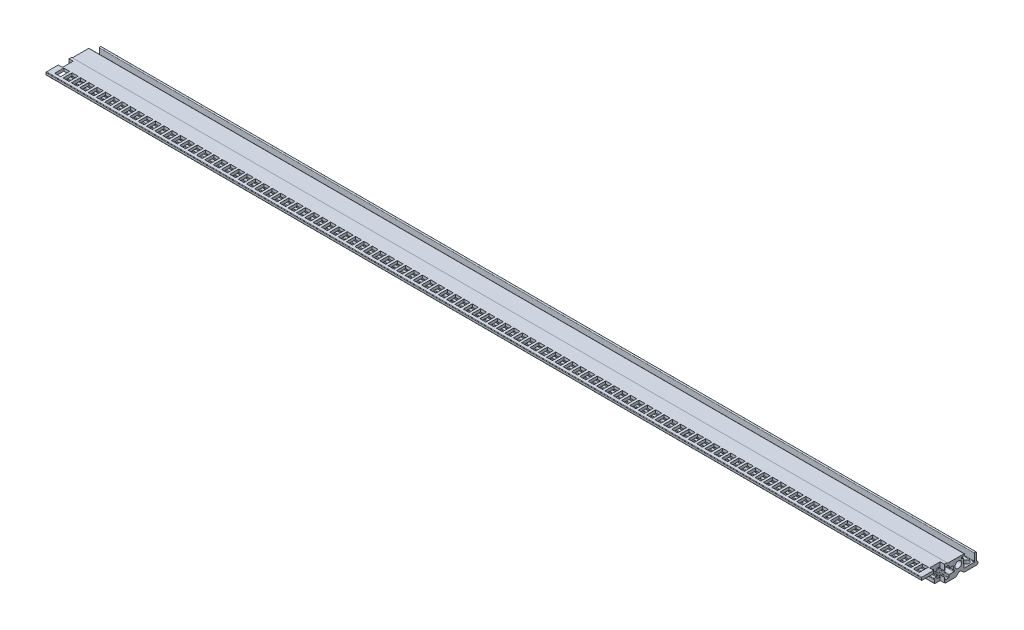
from build123d import *

# Parameters (mm, degrees)
SKETCH_1_R          = 2
EXTRUDE_1_DEPTH     = 266.7
EXTRUDE_4_DEPTH     = 533.4
EXTRUDE_3_DEPTH     = 533.4
CUT_EXTRUDE_1_REACH = 270.187
SKETCH_3_W          = 2.54
SKETCH_3_H          = 6.5
SKETCH_4_R          = 1.65
CUT_EXTRUDE_2_DEPTH = 9.8
SKETCH_5_W          = 3.6
SKETCH_5_H          = 5.5
CUT_EXTRUDE_3_DEPTH = 9.9
FILLET_1_R          = 0.3


with BuildPart() as part:
    # Sketch 1 → Extrude 1 (new, symmetric)
    with BuildSketch(Plane(origin=(0, 0, 0), x_dir=(0, 0, -1), z_dir=(1, 0, 0))):
        with BuildLine():
            Line((2.006061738, 2.145757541), (2.056061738, 2.145757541))
            ThreePointArc((2.056061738, 2.145757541), (2.197483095, 2.087178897), (2.256061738, 1.945757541))
            Line((2.256061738, 1.945757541), (2.256061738, -0.054242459))
            ThreePointArc((2.256061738, -0.054242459), (2.343929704, -0.266374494), (2.556061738, -0.354242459))
            Line((2.556061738, -0.354242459), (6.056061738, -0.354242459))
            ThreePointArc((6.056061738, -0.354242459), (6.245798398, -0.421863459), (6.350000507, -0.594242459))
            ThreePointArc((6.350000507, -0.594242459), (6.41946858, -0.709161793), (6.545959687, -0.754242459))
            Line((6.545959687, -0.754242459), (12.640079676, -0.754242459))
            ThreePointArc((12.640079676, -0.754242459), (12.748258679, -0.734059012), (12.841881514, -0.676224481))
            Line((12.841881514, -0.676224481), (14.682337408, 0.99691724))
            ThreePointArc((14.682337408, 0.99691724), (14.873755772, 1.07475547), (15.070100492, 1.010346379))
            ThreePointArc((15.070100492, 1.010346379), (15.256061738, 0.945757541), (15.442022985, 1.010346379))
            ThreePointArc((15.442022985, 1.010346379), (15.638367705, 1.07475547), (15.829786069, 0.99691724))
            Line((15.829786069, 0.99691724), (17.670241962, -0.676224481))
            ThreePointArc((17.670241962, -0.676224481), (17.763864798, -0.734059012), (17.872043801, -0.754242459))
            Line((17.872043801, -0.754242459), (25.156061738, -0.754242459))
            ThreePointArc((25.156061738, -0.754242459), (26.244537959, 0.186951), (25.470347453, 1.399903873))
            ThreePointArc((25.470347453, 1.399903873), (25.315526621, 1.508114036), (25.256061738, 1.687398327))
            Line((25.256061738, 1.687398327), (25.256061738, 6.045757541))
            ThreePointArc((25.256061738, 6.045757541), (24.756061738, 6.545757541), (24.256061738, 6.045757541))
            Line((24.256061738, 6.045757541), (24.256061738, 1.745757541))
            ThreePointArc((24.256061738, 1.745757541), (24.168193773, 1.533625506), (23.956061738, 1.445757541))
            Line((23.956061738, 1.445757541), (18.056061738, 1.445757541))
            ThreePointArc((18.056061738, 1.445757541), (17.843929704, 1.533625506), (17.756061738, 1.745757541))
            Line((17.756061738, 1.745757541), (17.756061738, 3.099347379))
            ThreePointArc((17.756061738, 3.099347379), (17.729266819, 3.199347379), (17.656061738, 3.27255246))
            ThreePointArc((17.656061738, 3.27255246), (17.582856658, 3.345757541), (17.556061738, 3.445757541))
            Line((17.556061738, 3.445757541), (17.556061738, 6.745757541))
            ThreePointArc((17.556061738, 6.745757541), (17.468193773, 6.957889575), (17.256061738, 7.045757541))
            Line((17.256061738, 7.045757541), (16.356061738, 7.045757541))
            ThreePointArc((16.356061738, 7.045757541), (16.143929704, 7.133625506), (16.056061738, 7.345757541))
            Line((16.056061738, 7.345757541), (16.056061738, 7.745757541))
            ThreePointArc((16.056061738, 7.745757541), (16.143929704, 7.957889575), (16.356061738, 8.045757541))
            Line((16.356061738, 8.045757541), (17.756061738, 8.045757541))
            ThreePointArc((17.756061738, 8.045757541), (17.968193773, 8.133625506), (18.056061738, 8.345757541))
            Line((18.056061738, 8.345757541), (18.056061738, 8.745757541))
            ThreePointArc((18.056061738, 8.745757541), (17.968193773, 8.957889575), (17.756061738, 9.045757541))
            Line((17.756061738, 9.045757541), (-7.943938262, 9.045757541))
            ThreePointArc((-7.943938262, 9.045757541), (-8.156070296, 8.957889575), (-8.243938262, 8.745757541))
            Line((-8.243938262, 8.745757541), (-8.243938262, 8.145757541))
            ThreePointArc((-8.243938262, 8.145757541), (-8.156070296, 7.933625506), (-7.943938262, 7.845757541))
            Line((-7.943938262, 7.845757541), (1.456061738, 7.845757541))
            ThreePointArc((1.456061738, 7.845757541), (1.668193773, 7.757889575), (1.756061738, 7.545757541))
            Line((1.756061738, 7.545757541), (1.756061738, 6.345757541))
            ThreePointArc((1.756061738, 6.345757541), (1.843929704, 6.133625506), (2.056061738, 6.045757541))
            Line((2.056061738, 6.045757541), (3.456061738, 6.045757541))
            ThreePointArc((3.456061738, 6.045757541), (3.668193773, 6.133625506), (3.756061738, 6.345757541))
            Line((3.756061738, 6.345757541), (3.756061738, 6.745757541))
            ThreePointArc((3.756061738, 6.745757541), (3.843929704, 6.957889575), (4.056061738, 7.045757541))
            Line((4.056061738, 7.045757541), (5.156061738, 7.045757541))
            ThreePointArc((5.156061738, 7.045757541), (5.368193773, 6.957889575), (5.456061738, 6.745757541))
            Line((5.456061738, 6.745757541), (5.456061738, 6.345757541))
            ThreePointArc((5.456061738, 6.345757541), (5.756061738, 6.045757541), (6.056061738, 6.345757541))
            Line((6.056061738, 6.345757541), (6.056061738, 7.405757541))
            ThreePointArc((6.056061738, 7.405757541), (6.143929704, 7.617889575), (6.356061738, 7.705757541))
            Line((6.356061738, 7.705757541), (8.156061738, 7.705757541))
            ThreePointArc((8.156061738, 7.705757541), (8.368193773, 7.617889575), (8.456061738, 7.405757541))
            Line((8.456061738, 7.405757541), (8.456061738, 6.345757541))
            ThreePointArc((8.456061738, 6.345757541), (8.543929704, 6.133625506), (8.756061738, 6.045757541))
            Line((8.756061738, 6.045757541), (10.980012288, 6.045757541))
            ThreePointArc((10.980012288, 6.045757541), (11.213256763, 5.934429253), (11.273389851, 5.683070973))
            ThreePointArc((11.273389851, 5.683070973), (11.28883719, 4.340010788), (11.879723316, 3.133817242))
            ThreePointArc((11.879723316, 3.133817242), (11.916556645, 2.816177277), (11.645985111, 2.645757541))
            Line((11.645985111, 2.645757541), (8.756061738, 2.645757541))
            ThreePointArc((8.756061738, 2.645757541), (8.543929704, 2.557889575), (8.456061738, 2.345757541))
            Line((8.456061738, 2.345757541), (8.456061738, 1.285757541))
            ThreePointArc((8.456061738, 1.285757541), (8.368193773, 1.073625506), (8.156061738, 0.985757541))
            Line((8.156061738, 0.985757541), (6.356061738, 0.985757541))
            ThreePointArc((6.356061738, 0.985757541), (6.143929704, 1.073625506), (6.056061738, 1.285757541))
            Line((6.056061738, 1.285757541), (6.056061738, 2.345757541))
            ThreePointArc((6.056061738, 2.345757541), (5.756061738, 2.645757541), (5.456061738, 2.345757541))
            Line((5.456061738, 2.345757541), (5.456061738, 1.945757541))
            ThreePointArc((5.456061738, 1.945757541), (5.368193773, 1.733625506), (5.156061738, 1.645757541))
            Line((5.156061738, 1.645757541), (4.056061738, 1.645757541))
            ThreePointArc((4.056061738, 1.645757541), (3.843929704, 1.733625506), (3.756061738, 1.945757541))
            Line((3.756061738, 1.945757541), (3.756061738, 2.345757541))
            ThreePointArc((3.756061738, 2.345757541), (3.668193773, 2.557889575), (3.456061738, 2.645757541))
            Line((3.456061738, 2.645757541), (2.006061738, 2.645757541))
            ThreePointArc((2.006061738, 2.645757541), (1.756061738, 2.395757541), (2.006061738, 2.145757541))
        make_face()
        with Locations((14.256061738, 5.045757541)):
            Circle(SKETCH_1_R, mode=Mode.SUBTRACT)
    extrude(amount=EXTRUDE_1_DEPTH, both=True)

    # Sketch 7 → Extrude 4 (add, through all)
    with BuildSketch(Plane(origin=(266.7, 0, 0), x_dir=(0, 0, -1), z_dir=(1, 0, 0))):
        with BuildLine():
            Line((-7.943938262, 9.045757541), (-8.243938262, 9.045757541))
            Line((-8.243938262, 9.045757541), (-8.243938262, 8.745757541))
            ThreePointArc((-8.243938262, 8.745757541), (-8.156070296, 8.957889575), (-7.943938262, 9.045757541))
        make_face()
    extrude(amount=-EXTRUDE_4_DEPTH)

    # Sketch 6 → Extrude 3 (add, through all)
    with BuildSketch(Plane.ZY.offset(266.7)):
        Polygon((-7.806061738, 9.045757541), (8.243938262, 9.045757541), (8.243938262, 9.545757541), (-7.306061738, 9.545757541), align=None)
    extrude(amount=-EXTRUDE_3_DEPTH)

    # Cut-Extrude 1: up to this face of the body (flat: up to its plane)
    cut_extrude_1_end = Plane(part.part.faces().sort_by_distance((0, -0.754242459, -9.593019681))[0])
    # Sketch 3 → Cut-Extrude 1 (cut, up to the picked face)
    with BuildSketch(Plane(origin=(0, 9.545757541, 0), x_dir=(1, 0, 0), z_dir=(0, 1, 0)), mode=Mode.PRIVATE) as cut_extrude_1_sk1:
        with Locations((265.43, 2.506061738)):
            Rectangle(SKETCH_3_W, SKETCH_3_H)
    cut_extrude_1_tool1 = split(extrude(cut_extrude_1_sk1.sketch, amount=-CUT_EXTRUDE_1_REACH, mode=Mode.PRIVATE), bisect_by=cut_extrude_1_end, keep=Keep.BOTH, mode=Mode.PRIVATE)
    # Sketch 3 → Cut-Extrude 1 (cut, up to the picked face)
    with BuildSketch(Plane(origin=(0, 9.545757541, 0), x_dir=(1, 0, 0), z_dir=(0, 1, 0)), mode=Mode.PRIVATE) as cut_extrude_1_sk2:
        with Locations((-265.43, 2.506061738)):
            Rectangle(SKETCH_3_W, SKETCH_3_H)
    cut_extrude_1_tool2 = split(extrude(cut_extrude_1_sk2.sketch, amount=-CUT_EXTRUDE_1_REACH, mode=Mode.PRIVATE), bisect_by=cut_extrude_1_end, keep=Keep.BOTH, mode=Mode.PRIVATE)
    add(cut_extrude_1_tool1.solids().sort_by(Axis((265.43, 9.545758, -2.506062), (0, -1, 0)))[0], mode=Mode.SUBTRACT)
    add(cut_extrude_1_tool2.solids().sort_by(Axis((-265.43, 9.545758, -2.506062), (0, -1, 0)))[0], mode=Mode.SUBTRACT)

    # Sketch 4 → Cut-Extrude 2 (cut)
    with BuildSketch(Plane(origin=(0, -0.754242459, 0), x_dir=(-1, 0, 0), z_dir=(0, -1, 0))):
        with Locations(Location((-264.16, 21.706061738, 0), (0, 0, 90))):
            Circle(SKETCH_4_R)
        with Locations(Location((-259.08, 21.706061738, 0), (0, 0, 90))):
            Circle(SKETCH_4_R)
        with Locations(Location((-254, 21.706061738, 0), (0, 0, 90))):
            Circle(SKETCH_4_R)
        with Locations(Location((-248.92, 21.706061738, 0), (0, 0, 90))):
            Circle(SKETCH_4_R)
        with Locations(Location((-243.84, 21.706061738, 0), (0, 0, 90))):
            Circle(SKETCH_4_R)
        with Locations(Location((-238.76, 21.706061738, 0), (0, 0, 90))):
            Circle(SKETCH_4_R)
        with Locations(Location((-233.68, 21.706061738, 0), (0, 0, 90))):
            Circle(SKETCH_4_R)
        with Locations(Location((-228.6, 21.706061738, 0), (0, 0, 90))):
            Circle(SKETCH_4_R)
        with Locations(Location((-223.52, 21.706061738, 0), (0, 0, 90))):
            Circle(SKETCH_4_R)
        with Locations(Location((-218.44, 21.706061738, 0), (0, 0, 90))):
            Circle(SKETCH_4_R)
        with Locations(Location((-213.36, 21.706061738, 0), (0, 0, 90))):
            Circle(SKETCH_4_R)
        with Locations(Location((-208.28, 21.706061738, 0), (0, 0, 90))):
            Circle(SKETCH_4_R)
        with Locations(Location((-203.2, 21.706061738, 0), (0, 0, 90))):
            Circle(SKETCH_4_R)
        with Locations(Location((-198.12, 21.706061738, 0), (0, 0, 90))):
            Circle(SKETCH_4_R)
        with Locations(Location((-193.04, 21.706061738, 0), (0, 0, 90))):
            Circle(SKETCH_4_R)
        with Locations(Location((-187.96, 21.706061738, 0), (0, 0, 90))):
            Circle(SKETCH_4_R)
        with Locations(Location((-182.88, 21.706061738, 0), (0, 0, 90))):
            Circle(SKETCH_4_R)
        with Locations(Location((-177.8, 21.706061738, 0), (0, 0, 90))):
            Circle(SKETCH_4_R)
        with Locations(Location((-172.72, 21.706061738, 0), (0, 0, 90))):
            Circle(SKETCH_4_R)
        with Locations(Location((-167.64, 21.706061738, 0), (0, 0, 90))):
            Circle(SKETCH_4_R)
        with Locations(Location((-162.56, 21.706061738, 0), (0, 0, 90))):
            Circle(SKETCH_4_R)
        with Locations(Location((-157.48, 21.706061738, 0), (0, 0, 90))):
            Circle(SKETCH_4_R)
        with Locations(Location((-152.4, 21.706061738, 0), (0, 0, 90))):
            Circle(SKETCH_4_R)
        with Locations(Location((-147.32, 21.706061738, 0), (0, 0, 90))):
            Circle(SKETCH_4_R)
        with Locations(Location((-142.24, 21.706061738, 0), (0, 0, 90))):
            Circle(SKETCH_4_R)
        with Locations(Location((-137.16, 21.706061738, 0), (0, 0, 90))):
            Circle(SKETCH_4_R)
        with Locations(Location((-132.08, 21.706061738, 0), (0, 0, 90))):
            Circle(SKETCH_4_R)
        with Locations(Location((-127, 21.706061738, 0), (0, 0, 90))):
            Circle(SKETCH_4_R)
        with Locations(Location((-121.92, 21.706061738, 0), (0, 0, 90))):
            Circle(SKETCH_4_R)
        with Locations(Location((-116.84, 21.706061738, 0), (0, 0, 90))):
            Circle(SKETCH_4_R)
        with Locations(Location((-111.76, 21.706061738, 0), (0, 0, 90))):
            Circle(SKETCH_4_R)
        with Locations(Location((-106.68, 21.706061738, 0), (0, 0, 90))):
            Circle(SKETCH_4_R)
        with Locations(Location((-101.6, 21.706061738, 0), (0, 0, 90))):
            Circle(SKETCH_4_R)
        with Locations(Location((-96.52, 21.706061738, 0), (0, 0, 90))):
            Circle(SKETCH_4_R)
        with Locations(Location((-91.44, 21.706061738, 0), (0, 0, 90))):
            Circle(SKETCH_4_R)
        with Locations(Location((-86.36, 21.706061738, 0), (0, 0, 90))):
            Circle(SKETCH_4_R)
        with Locations(Location((-81.28, 21.706061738, 0), (0, 0, 90))):
            Circle(SKETCH_4_R)
        with Locations(Location((-76.2, 21.706061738, 0), (0, 0, 90))):
            Circle(SKETCH_4_R)
        with Locations(Location((-71.12, 21.706061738, 0), (0, 0, 90))):
            Circle(SKETCH_4_R)
        with Locations(Location((-66.04, 21.706061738, 0), (0, 0, 90))):
            Circle(SKETCH_4_R)
        with Locations(Location((-60.96, 21.706061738, 0), (0, 0, 90))):
            Circle(SKETCH_4_R)
        with Locations(Location((-55.88, 21.706061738, 0), (0, 0, 90))):
            Circle(SKETCH_4_R)
        with Locations(Location((-50.8, 21.706061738, 0), (0, 0, 90))):
            Circle(SKETCH_4_R)
        with Locations(Location((-45.72, 21.706061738, 0), (0, 0, 90))):
            Circle(SKETCH_4_R)
        with Locations(Location((-40.64, 21.706061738, 0), (0, 0, 90))):
            Circle(SKETCH_4_R)
        with Locations(Location((-35.56, 21.706061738, 0), (0, 0, 90))):
            Circle(SKETCH_4_R)
        with Locations(Location((-30.48, 21.706061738, 0), (0, 0, 90))):
            Circle(SKETCH_4_R)
        with Locations(Location((-25.4, 21.706061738, 0), (0, 0, 90))):
            Circle(SKETCH_4_R)
        with Locations(Location((-20.32, 21.706061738, 0), (0, 0, 90))):
            Circle(SKETCH_4_R)
        with Locations(Location((-15.24, 21.706061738, 0), (0, 0, 90))):
            Circle(SKETCH_4_R)
        with Locations(Location((-10.16, 21.706061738, 0), (0, 0, 90))):
            Circle(SKETCH_4_R)
        with Locations(Location((-5.08, 21.706061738, 0), (0, 0, 90))):
            Circle(SKETCH_4_R)
        with Locations(Location((0, 21.706061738, 0), (0, 0, 90))):
            Circle(SKETCH_4_R)
        with Locations(Location((5.08, 21.706061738, 0), (0, 0, 90))):
            Circle(SKETCH_4_R)
        with Locations(Location((10.16, 21.706061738, 0), (0, 0, 90))):
            Circle(SKETCH_4_R)
        with Locations(Location((15.24, 21.706061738, 0), (0, 0, 90))):
            Circle(SKETCH_4_R)
        with Locations(Location((20.32, 21.706061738, 0), (0, 0, 90))):
            Circle(SKETCH_4_R)
        with Locations(Location((25.4, 21.706061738, 0), (0, 0, 90))):
            Circle(SKETCH_4_R)
        with Locations(Location((30.48, 21.706061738, 0), (0, 0, 90))):
            Circle(SKETCH_4_R)
        with Locations(Location((35.56, 21.706061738, 0), (0, 0, 90))):
            Circle(SKETCH_4_R)
        with Locations(Location((40.64, 21.706061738, 0), (0, 0, 90))):
            Circle(SKETCH_4_R)
        with Locations(Location((45.72, 21.706061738, 0), (0, 0, 90))):
            Circle(SKETCH_4_R)
        with Locations(Location((50.8, 21.706061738, 0), (0, 0, 90))):
            Circle(SKETCH_4_R)
        with Locations(Location((55.88, 21.706061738, 0), (0, 0, 90))):
            Circle(SKETCH_4_R)
        with Locations(Location((60.96, 21.706061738, 0), (0, 0, 90))):
            Circle(SKETCH_4_R)
        with Locations(Location((66.04, 21.706061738, 0), (0, 0, 90))):
            Circle(SKETCH_4_R)
        with Locations(Location((71.12, 21.706061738, 0), (0, 0, 90))):
            Circle(SKETCH_4_R)
        with Locations(Location((76.2, 21.706061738, 0), (0, 0, 90))):
            Circle(SKETCH_4_R)
        with Locations(Location((81.28, 21.706061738, 0), (0, 0, 90))):
            Circle(SKETCH_4_R)
        with Locations(Location((86.36, 21.706061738, 0), (0, 0, 90))):
            Circle(SKETCH_4_R)
        with Locations(Location((91.44, 21.706061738, 0), (0, 0, 90))):
            Circle(SKETCH_4_R)
        with Locations(Location((96.52, 21.706061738, 0), (0, 0, 90))):
            Circle(SKETCH_4_R)
        with Locations(Location((101.6, 21.706061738, 0), (0, 0, 90))):
            Circle(SKETCH_4_R)
        with Locations(Location((106.68, 21.706061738, 0), (0, 0, 90))):
            Circle(SKETCH_4_R)
        with Locations(Location((111.76, 21.706061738, 0), (0, 0, 90))):
            Circle(SKETCH_4_R)
        with Locations(Location((116.84, 21.706061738, 0), (0, 0, 90))):
            Circle(SKETCH_4_R)
        with Locations(Location((121.92, 21.706061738, 0), (0, 0, 90))):
            Circle(SKETCH_4_R)
        with Locations(Location((127, 21.706061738, 0), (0, 0, 90))):
            Circle(SKETCH_4_R)
        with Locations(Location((132.08, 21.706061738, 0), (0, 0, 90))):
            Circle(SKETCH_4_R)
        with Locations(Location((137.16, 21.706061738, 0), (0, 0, 90))):
            Circle(SKETCH_4_R)
        with Locations(Location((142.24, 21.706061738, 0), (0, 0, 90))):
            Circle(SKETCH_4_R)
        with Locations(Location((147.32, 21.706061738, 0), (0, 0, 90))):
            Circle(SKETCH_4_R)
        with Locations(Location((152.4, 21.706061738, 0), (0, 0, 90))):
            Circle(SKETCH_4_R)
        with Locations(Location((157.48, 21.706061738, 0), (0, 0, 90))):
            Circle(SKETCH_4_R)
        with Locations(Location((162.56, 21.706061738, 0), (0, 0, 90))):
            Circle(SKETCH_4_R)
        with Locations(Location((167.64, 21.706061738, 0), (0, 0, 90))):
            Circle(SKETCH_4_R)
        with Locations(Location((172.72, 21.706061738, 0), (0, 0, 90))):
            Circle(SKETCH_4_R)
        with Locations(Location((177.8, 21.706061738, 0), (0, 0, 90))):
            Circle(SKETCH_4_R)
        with Locations(Location((182.88, 21.706061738, 0), (0, 0, 90))):
            Circle(SKETCH_4_R)
        with Locations(Location((187.96, 21.706061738, 0), (0, 0, 90))):
            Circle(SKETCH_4_R)
        with Locations(Location((193.04, 21.706061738, 0), (0, 0, 90))):
            Circle(SKETCH_4_R)
        with Locations(Location((198.12, 21.706061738, 0), (0, 0, 90))):
            Circle(SKETCH_4_R)
        with Locations(Location((203.2, 21.706061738, 0), (0, 0, 90))):
            Circle(SKETCH_4_R)
        with Locations(Location((208.28, 21.706061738, 0), (0, 0, 90))):
            Circle(SKETCH_4_R)
        with Locations(Location((213.36, 21.706061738, 0), (0, 0, 90))):
            Circle(SKETCH_4_R)
        with Locations(Location((218.44, 21.706061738, 0), (0, 0, 90))):
            Circle(SKETCH_4_R)
        with Locations(Location((223.52, 21.706061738, 0), (0, 0, 90))):
            Circle(SKETCH_4_R)
        with Locations(Location((228.6, 21.706061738, 0), (0, 0, 90))):
            Circle(SKETCH_4_R)
        with Locations(Location((233.68, 21.706061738, 0), (0, 0, 90))):
            Circle(SKETCH_4_R)
        with Locations(Location((238.76, 21.706061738, 0), (0, 0, 90))):
            Circle(SKETCH_4_R)
        with Locations(Location((243.84, 21.706061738, 0), (0, 0, 90))):
            Circle(SKETCH_4_R)
        with Locations(Location((248.92, 21.706061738, 0), (0, 0, 90))):
            Circle(SKETCH_4_R)
        with Locations(Location((254, 21.706061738, 0), (0, 0, 90))):
            Circle(SKETCH_4_R)
        with Locations(Location((259.08, 21.706061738, 0), (0, 0, 90))):
            Circle(SKETCH_4_R)
        with Locations(Location((264.16, 21.706061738, 0), (0, 0, 90))):
            Circle(SKETCH_4_R)
    extrude(amount=-CUT_EXTRUDE_2_DEPTH, mode=Mode.SUBTRACT)

    # Sketch 5 → Cut-Extrude 3 (cut)
    with BuildSketch(Plane(origin=(0, 9.545757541, 0), x_dir=(1, 0, 0), z_dir=(0, 1, 0))):
        with Locations((-261.62, -3.443938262)):
            Rectangle(SKETCH_5_W, SKETCH_5_H)
        with Locations((165.1, -3.443938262)):
            Rectangle(SKETCH_5_W, SKETCH_5_H)
        with Locations((-256.54, -3.443938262)):
            Rectangle(SKETCH_5_W, SKETCH_5_H)
        with Locations((-251.46, -3.443938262)):
            Rectangle(SKETCH_5_W, SKETCH_5_H)
        with Locations((-246.38, -3.443938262)):
            Rectangle(SKETCH_5_W, SKETCH_5_H)
        with Locations((-241.3, -3.443938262)):
            Rectangle(SKETCH_5_W, SKETCH_5_H)
        with Locations((-236.22, -3.443938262)):
            Rectangle(SKETCH_5_W, SKETCH_5_H)
        with Locations((-231.14, -3.443938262)):
            Rectangle(SKETCH_5_W, SKETCH_5_H)
        with Locations((-226.06, -3.443938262)):
            Rectangle(SKETCH_5_W, SKETCH_5_H)
        with Locations((-220.98, -3.443938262)):
            Rectangle(SKETCH_5_W, SKETCH_5_H)
        with Locations((-215.9, -3.443938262)):
            Rectangle(SKETCH_5_W, SKETCH_5_H)
        with Locations((-210.82, -3.443938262)):
            Rectangle(SKETCH_5_W, SKETCH_5_H)
        with Locations((-205.74, -3.443938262)):
            Rectangle(SKETCH_5_W, SKETCH_5_H)
        with Locations((-200.66, -3.443938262)):
            Rectangle(SKETCH_5_W, SKETCH_5_H)
        with Locations((-195.58, -3.443938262)):
            Rectangle(SKETCH_5_W, SKETCH_5_H)
        with Locations((-190.5, -3.443938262)):
            Rectangle(SKETCH_5_W, SKETCH_5_H)
        with Locations((-185.42, -3.443938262)):
            Rectangle(SKETCH_5_W, SKETCH_5_H)
        with Locations((-180.34, -3.443938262)):
            Rectangle(SKETCH_5_W, SKETCH_5_H)
        with Locations((-175.26, -3.443938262)):
            Rectangle(SKETCH_5_W, SKETCH_5_H)
        with Locations((-170.18, -3.443938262)):
            Rectangle(SKETCH_5_W, SKETCH_5_H)
        with Locations((-165.1, -3.443938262)):
            Rectangle(SKETCH_5_W, SKETCH_5_H)
        with Locations((-160.02, -3.443938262)):
            Rectangle(SKETCH_5_W, SKETCH_5_H)
        with Locations((-154.94, -3.443938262)):
            Rectangle(SKETCH_5_W, SKETCH_5_H)
        with Locations((-149.86, -3.443938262)):
            Rectangle(SKETCH_5_W, SKETCH_5_H)
        with Locations((-144.78, -3.443938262)):
            Rectangle(SKETCH_5_W, SKETCH_5_H)
        with Locations((-139.7, -3.443938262)):
            Rectangle(SKETCH_5_W, SKETCH_5_H)
        with Locations((-134.62, -3.443938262)):
            Rectangle(SKETCH_5_W, SKETCH_5_H)
        with Locations((-129.54, -3.443938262)):
            Rectangle(SKETCH_5_W, SKETCH_5_H)
        with Locations((-124.46, -3.443938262)):
            Rectangle(SKETCH_5_W, SKETCH_5_H)
        with Locations((-119.38, -3.443938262)):
            Rectangle(SKETCH_5_W, SKETCH_5_H)
        with Locations((-114.3, -3.443938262)):
            Rectangle(SKETCH_5_W, SKETCH_5_H)
        with Locations((-109.22, -3.443938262)):
            Rectangle(SKETCH_5_W, SKETCH_5_H)
        with Locations((-104.14, -3.443938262)):
            Rectangle(SKETCH_5_W, SKETCH_5_H)
        with Locations((-99.06, -3.443938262)):
            Rectangle(SKETCH_5_W, SKETCH_5_H)
        with Locations((-93.98, -3.443938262)):
            Rectangle(SKETCH_5_W, SKETCH_5_H)
        with Locations((-88.9, -3.443938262)):
            Rectangle(SKETCH_5_W, SKETCH_5_H)
        with Locations((-83.82, -3.443938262)):
            Rectangle(SKETCH_5_W, SKETCH_5_H)
        with Locations((-78.74, -3.443938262)):
            Rectangle(SKETCH_5_W, SKETCH_5_H)
        with Locations((-73.66, -3.443938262)):
            Rectangle(SKETCH_5_W, SKETCH_5_H)
        with Locations((-68.58, -3.443938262)):
            Rectangle(SKETCH_5_W, SKETCH_5_H)
        with Locations((-63.5, -3.443938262)):
            Rectangle(SKETCH_5_W, SKETCH_5_H)
        with Locations((-58.42, -3.443938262)):
            Rectangle(SKETCH_5_W, SKETCH_5_H)
        with Locations((-53.34, -3.443938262)):
            Rectangle(SKETCH_5_W, SKETCH_5_H)
        with Locations((-48.26, -3.443938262)):
            Rectangle(SKETCH_5_W, SKETCH_5_H)
        with Locations((-43.18, -3.443938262)):
            Rectangle(SKETCH_5_W, SKETCH_5_H)
        with Locations((-38.1, -3.443938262)):
            Rectangle(SKETCH_5_W, SKETCH_5_H)
        with Locations((-33.02, -3.443938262)):
            Rectangle(SKETCH_5_W, SKETCH_5_H)
        with Locations((-27.94, -3.443938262)):
            Rectangle(SKETCH_5_W, SKETCH_5_H)
        with Locations((-22.86, -3.443938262)):
            Rectangle(SKETCH_5_W, SKETCH_5_H)
        with Locations((-17.78, -3.443938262)):
            Rectangle(SKETCH_5_W, SKETCH_5_H)
        with Locations((-12.7, -3.443938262)):
            Rectangle(SKETCH_5_W, SKETCH_5_H)
        with Locations((-7.62, -3.443938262)):
            Rectangle(SKETCH_5_W, SKETCH_5_H)
        with Locations((-2.54, -3.443938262)):
            Rectangle(SKETCH_5_W, SKETCH_5_H)
        with Locations((2.54, -3.443938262)):
            Rectangle(SKETCH_5_W, SKETCH_5_H)
        with Locations((7.62, -3.443938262)):
            Rectangle(SKETCH_5_W, SKETCH_5_H)
        with Locations((12.7, -3.443938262)):
            Rectangle(SKETCH_5_W, SKETCH_5_H)
        with Locations((17.78, -3.443938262)):
            Rectangle(SKETCH_5_W, SKETCH_5_H)
        with Locations((22.86, -3.443938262)):
            Rectangle(SKETCH_5_W, SKETCH_5_H)
        with Locations((27.94, -3.443938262)):
            Rectangle(SKETCH_5_W, SKETCH_5_H)
        with Locations((33.02, -3.443938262)):
            Rectangle(SKETCH_5_W, SKETCH_5_H)
        with Locations((38.1, -3.443938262)):
            Rectangle(SKETCH_5_W, SKETCH_5_H)
        with Locations((43.18, -3.443938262)):
            Rectangle(SKETCH_5_W, SKETCH_5_H)
        with Locations((48.26, -3.443938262)):
            Rectangle(SKETCH_5_W, SKETCH_5_H)
        with Locations((53.34, -3.443938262)):
            Rectangle(SKETCH_5_W, SKETCH_5_H)
        with Locations((58.42, -3.443938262)):
            Rectangle(SKETCH_5_W, SKETCH_5_H)
        with Locations((63.5, -3.443938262)):
            Rectangle(SKETCH_5_W, SKETCH_5_H)
        with Locations((68.58, -3.443938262)):
            Rectangle(SKETCH_5_W, SKETCH_5_H)
        with Locations((73.66, -3.443938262)):
            Rectangle(SKETCH_5_W, SKETCH_5_H)
        with Locations((78.74, -3.443938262)):
            Rectangle(SKETCH_5_W, SKETCH_5_H)
        with Locations((83.82, -3.443938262)):
            Rectangle(SKETCH_5_W, SKETCH_5_H)
        with Locations((88.9, -3.443938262)):
            Rectangle(SKETCH_5_W, SKETCH_5_H)
        with Locations((93.98, -3.443938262)):
            Rectangle(SKETCH_5_W, SKETCH_5_H)
        with Locations((99.06, -3.443938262)):
            Rectangle(SKETCH_5_W, SKETCH_5_H)
        with Locations((104.14, -3.443938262)):
            Rectangle(SKETCH_5_W, SKETCH_5_H)
        with Locations((109.22, -3.443938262)):
            Rectangle(SKETCH_5_W, SKETCH_5_H)
        with Locations((114.3, -3.443938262)):
            Rectangle(SKETCH_5_W, SKETCH_5_H)
        with Locations((119.38, -3.443938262)):
            Rectangle(SKETCH_5_W, SKETCH_5_H)
        with Locations((124.46, -3.443938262)):
            Rectangle(SKETCH_5_W, SKETCH_5_H)
        with Locations((129.54, -3.443938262)):
            Rectangle(SKETCH_5_W, SKETCH_5_H)
        with Locations((134.62, -3.443938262)):
            Rectangle(SKETCH_5_W, SKETCH_5_H)
        with Locations((139.7, -3.443938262)):
            Rectangle(SKETCH_5_W, SKETCH_5_H)
        with Locations((144.78, -3.443938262)):
            Rectangle(SKETCH_5_W, SKETCH_5_H)
        with Locations((149.86, -3.443938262)):
            Rectangle(SKETCH_5_W, SKETCH_5_H)
        with Locations((154.94, -3.443938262)):
            Rectangle(SKETCH_5_W, SKETCH_5_H)
        with Locations((160.02, -3.443938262)):
            Rectangle(SKETCH_5_W, SKETCH_5_H)
        with Locations((170.18, -3.443938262)):
            Rectangle(SKETCH_5_W, SKETCH_5_H)
        with Locations((175.26, -3.443938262)):
            Rectangle(SKETCH_5_W, SKETCH_5_H)
        with Locations((180.34, -3.443938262)):
            Rectangle(SKETCH_5_W, SKETCH_5_H)
        with Locations((185.42, -3.443938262)):
            Rectangle(SKETCH_5_W, SKETCH_5_H)
        with Locations((190.5, -3.443938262)):
            Rectangle(SKETCH_5_W, SKETCH_5_H)
        with Locations((195.58, -3.443938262)):
            Rectangle(SKETCH_5_W, SKETCH_5_H)
        with Locations((200.66, -3.443938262)):
            Rectangle(SKETCH_5_W, SKETCH_5_H)
        with Locations((205.74, -3.443938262)):
            Rectangle(SKETCH_5_W, SKETCH_5_H)
        with Locations((210.82, -3.443938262)):
            Rectangle(SKETCH_5_W, SKETCH_5_H)
        with Locations((215.9, -3.443938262)):
            Rectangle(SKETCH_5_W, SKETCH_5_H)
        with Locations((220.98, -3.443938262)):
            Rectangle(SKETCH_5_W, SKETCH_5_H)
        with Locations((226.06, -3.443938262)):
            Rectangle(SKETCH_5_W, SKETCH_5_H)
        with Locations((231.14, -3.443938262)):
            Rectangle(SKETCH_5_W, SKETCH_5_H)
        with Locations((236.22, -3.443938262)):
            Rectangle(SKETCH_5_W, SKETCH_5_H)
        with Locations((241.3, -3.443938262)):
            Rectangle(SKETCH_5_W, SKETCH_5_H)
        with Locations((246.38, -3.443938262)):
            Rectangle(SKETCH_5_W, SKETCH_5_H)
        with Locations((251.46, -3.443938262)):
            Rectangle(SKETCH_5_W, SKETCH_5_H)
        with Locations((256.54, -3.443938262)):
            Rectangle(SKETCH_5_W, SKETCH_5_H)
        with Locations((261.62, -3.443938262)):
            Rectangle(SKETCH_5_W, SKETCH_5_H)
    extrude(amount=-CUT_EXTRUDE_3_DEPTH, mode=Mode.SUBTRACT)

    # Fillet 1
    fillet_1_edges = [part.edges().sort_by_distance(p)[0] for p in [
        (0, 9.545757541, 8.243938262),
    ]]
    fillet(fillet_1_edges, radius=FILLET_1_R)


solid = part.part
